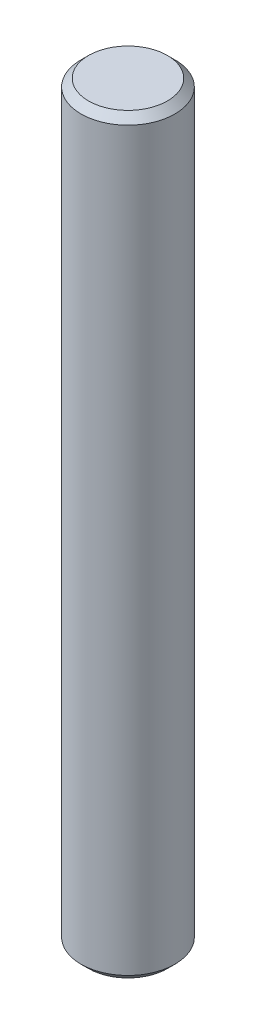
from build123d import *

# Parameters (mm, degrees)
SKETCH1_R           = 12.5
BOSS_EXTRUDE1_DEPTH = 200
CHAMFER1_SIZE       = 2


with BuildPart() as part:
    # Sketch1 → Boss-Extrude1 (new body)
    with BuildSketch(Plane(origin=(0, 0, 0), x_dir=(1, 0, 0), z_dir=(0, 1, 0))):
        with Locations(Location((0, 0, 0), (0, 0, 270))):
            Circle(SKETCH1_R)
    extrude(amount=BOSS_EXTRUDE1_DEPTH)

    # Chamfer1
    chamfer1_edges = [part.edges().sort_by_distance(p)[0] for p in [
        (0, 0, -12.5),
        (0, 200, -12.5),
    ]]
    chamfer(chamfer1_edges, length=CHAMFER1_SIZE)


solid = part.part
